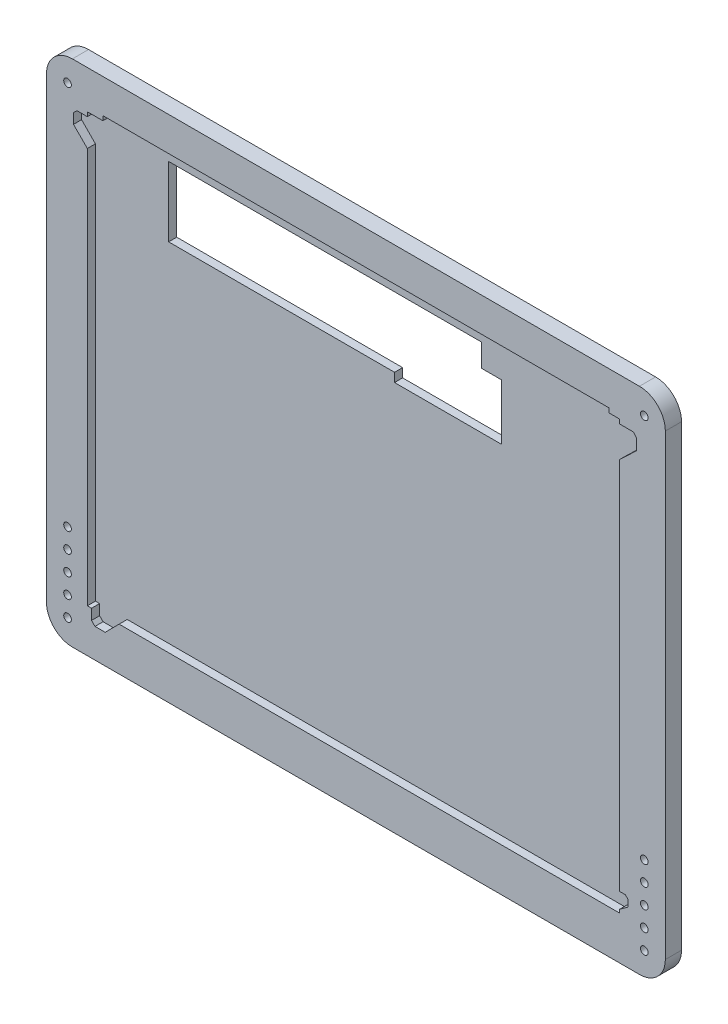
from build123d import *

# Parameters (mm, degrees)
BOSS_EXTRUDE1_DEPTH = 6.35
CUT_EXTRUDE1_DEPTH  = 3.175
SKETCH4_R           = 1.5
CUT_EXTRUDE2_DEPTH  = 553.53444062
CUT_EXTRUDE3_DEPTH  = 6.604
SKETCH8_W           = 198.705603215
SKETCH8_H           = 3.46165798
CUT_EXTRUDE4_DEPTH  = 3.175


with BuildPart() as part:
    # Sketch1 → Boss-Extrude1 (new body)
    with BuildSketch(Plane.XY):
        with BuildLine():
            Line((285.97186037, 190.015000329), (508.635031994, 190.015000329))
            ThreePointArc((508.635031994, 190.015000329), (515.81923689, 187.039205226), (518.795031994, 179.855000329))
            Line((518.795031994, 179.855000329), (518.795031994, 0.147179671))
            ThreePointArc((518.795031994, 0.147179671), (515.81923689, -7.037025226), (508.635031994, -10.012820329))
            Line((508.635031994, -10.012820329), (285.97186037, -10.012820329))
            ThreePointArc((285.97186037, -10.012820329), (278.787655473, -7.037025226), (275.81186037, 0.147179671))
            Line((275.81186037, 0.147179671), (275.81186037, 179.855000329))
            ThreePointArc((275.81186037, 179.855000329), (278.787655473, 187.039205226), (285.97186037, 190.015000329))
        make_face()
    extrude(amount=BOSS_EXTRUDE1_DEPTH)

    # Sketch3 → Cut-Extrude1 (cut)
    with BuildSketch(Plane.XY.offset(6.35)):
        Polygon((507.386455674, 167.404390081), (507.386455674, 167.966136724), (507.386455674, 171.966636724), (506.254962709, 173.289969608), (500.851381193, 173.289969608), (500.851381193, 174.966376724), (291.850021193, 174.966376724), (291.850021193, 173.289969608), (287.852061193, 173.289969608), (286.41004258, 171.966636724), (286.41004258, 167.966136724), (291.850021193, 162.470783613), (291.850021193, 6.965696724), (293.485330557, 6.965696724), (293.485330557, 2.811675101), (294.849761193, 1.455927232), (298.850261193, 1.455927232), (304.324968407, 6.965696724), (500.851381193, 6.965696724), (500.851381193, 8.273998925), (504.237895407, 10.732039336), (504.237895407, 13.190079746), (503.117775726, 14.341313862), (500.851381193, 14.341313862), (500.851381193, 161.208119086), align=None)
    extrude(amount=-CUT_EXTRUDE1_DEPTH, mode=Mode.SUBTRACT)

    # Sketch4 → Cut-Extrude2 (cut, through all)
    with BuildSketch(Plane.XY.offset(6.35)):
        with Locations((284.070853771, 180.920119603)):
            Circle(SKETCH4_R)
        with Locations(Location((510.536038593, 180.920119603, 0), (0, 0, 180))):
            Circle(SKETCH4_R)
        with Locations((510.536038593, -0.917939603)):
            Circle(SKETCH4_R)
        with Locations(Location((284.070853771, -0.917939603, 0), (0, 0, 180))):
            Circle(SKETCH4_R)
        with Locations((284.070853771, 6.792501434)):
            Circle(SKETCH4_R)
        with Locations((284.070853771, 14.502942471)):
            Circle(SKETCH4_R)
        with Locations((284.070853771, 22.213383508)):
            Circle(SKETCH4_R)
        with Locations((284.070853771, 29.923824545)):
            Circle(SKETCH4_R)
        with Locations(Location((510.536038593, 29.923824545, 0), (0, 0, 180))):
            Circle(SKETCH4_R)
        with Locations(Location((510.536038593, 22.213383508, 0), (0, 0, 180))):
            Circle(SKETCH4_R)
        with Locations(Location((510.536038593, 14.502942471, 0), (0, 0, 180))):
            Circle(SKETCH4_R)
        with Locations(Location((510.536038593, 6.792501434, 0), (0, 0, 180))):
            Circle(SKETCH4_R)
    extrude(amount=-CUT_EXTRUDE2_DEPTH, mode=Mode.SUBTRACT)

    # Sketch6 → Cut-Extrude3 (cut)
    with BuildSketch(Plane(origin=(0, 0, 0), x_dir=(-1, 0, 0), z_dir=(0, 0, -1))):
        Polygon((-443.535847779, 161.933269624), (-451.353574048, 161.933269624), (-451.353574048, 140.020912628), (-409.29157316, 140.020912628), (-409.29157316, 143.510493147), (-320.595307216, 143.510493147), (-320.595307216, 161.933269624), (-320.595307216, 170.863631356), (-443.535847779, 170.863631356), align=None)
    extrude(amount=-CUT_EXTRUDE3_DEPTH, mode=Mode.SUBTRACT)

    # Sketch8 → Cut-Extrude4 (cut)
    with BuildSketch(Plane.XY.offset(6.35)):
        with Locations((397.303446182, 174.966376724)):
            Rectangle(SKETCH8_W, SKETCH8_H)
    extrude(amount=-CUT_EXTRUDE4_DEPTH, mode=Mode.SUBTRACT)


solid = part.part
